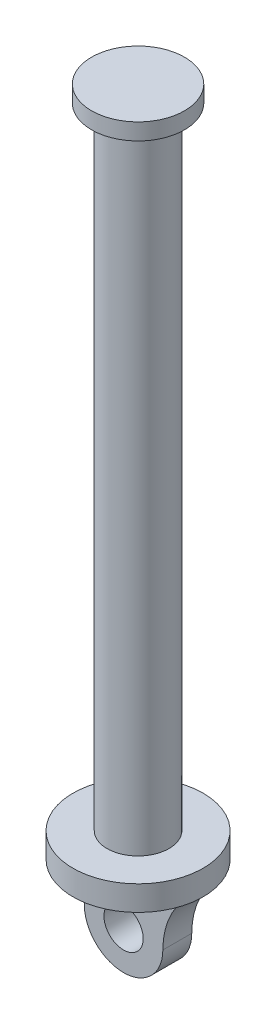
from build123d import *

# Parameters (mm, degrees)
SKETCH2_R           = 22.5
BOSS_EXTRUDE1_DEPTH = 8
SKETCH3_R           = 15
BOSS_EXTRUDE2_DEPTH = 305
SKETCH4_R           = 31.5
BOSS_EXTRUDE3_DEPTH = 12
SKETCH5_R           = 9.5
BOSS_EXTRUDE4_DEPTH = 7


with BuildPart() as part:
    # Sketch2 → Boss-Extrude1 (new body)
    with BuildSketch(Plane(origin=(0, 0, 0), x_dir=(1, 0, 0), z_dir=(0, 1, 0))):
        with Locations(Location((0, 0, 0), (0, 0, 270))):
            Circle(SKETCH2_R)
    extrude(amount=-BOSS_EXTRUDE1_DEPTH)

    # Sketch3 → Boss-Extrude2 (add)
    with BuildSketch(Plane.XZ.offset(8)):
        with Locations(Location((0, 0, 0), (0, 0, 270))):
            Circle(SKETCH3_R)
    extrude(amount=BOSS_EXTRUDE2_DEPTH)

    # Sketch4 → Boss-Extrude3 (add)
    with BuildSketch(Plane.XZ.offset(313)):
        with Locations(Location((0, 0, 0), (0, 0, 270))):
            Circle(SKETCH4_R)
    extrude(amount=BOSS_EXTRUDE3_DEPTH)

    # Sketch5 → Boss-Extrude4 (add, symmetric)
    with BuildSketch(Plane.XY):
        with BuildLine():
            Line((-28.5, -325), (28.5, -325))
            ThreePointArc((28.5, -325), (21.455054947, -336.62792088), (19, -350))
            ThreePointArc((19, -350), (0, -369), (-19, -350))
            ThreePointArc((-19, -350), (-21.455054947, -336.62792088), (-28.5, -325))
        make_face()
        with Locations((0, -350)):
            Circle(SKETCH5_R, mode=Mode.SUBTRACT)
    extrude(amount=BOSS_EXTRUDE4_DEPTH, both=True)


solid = part.part
